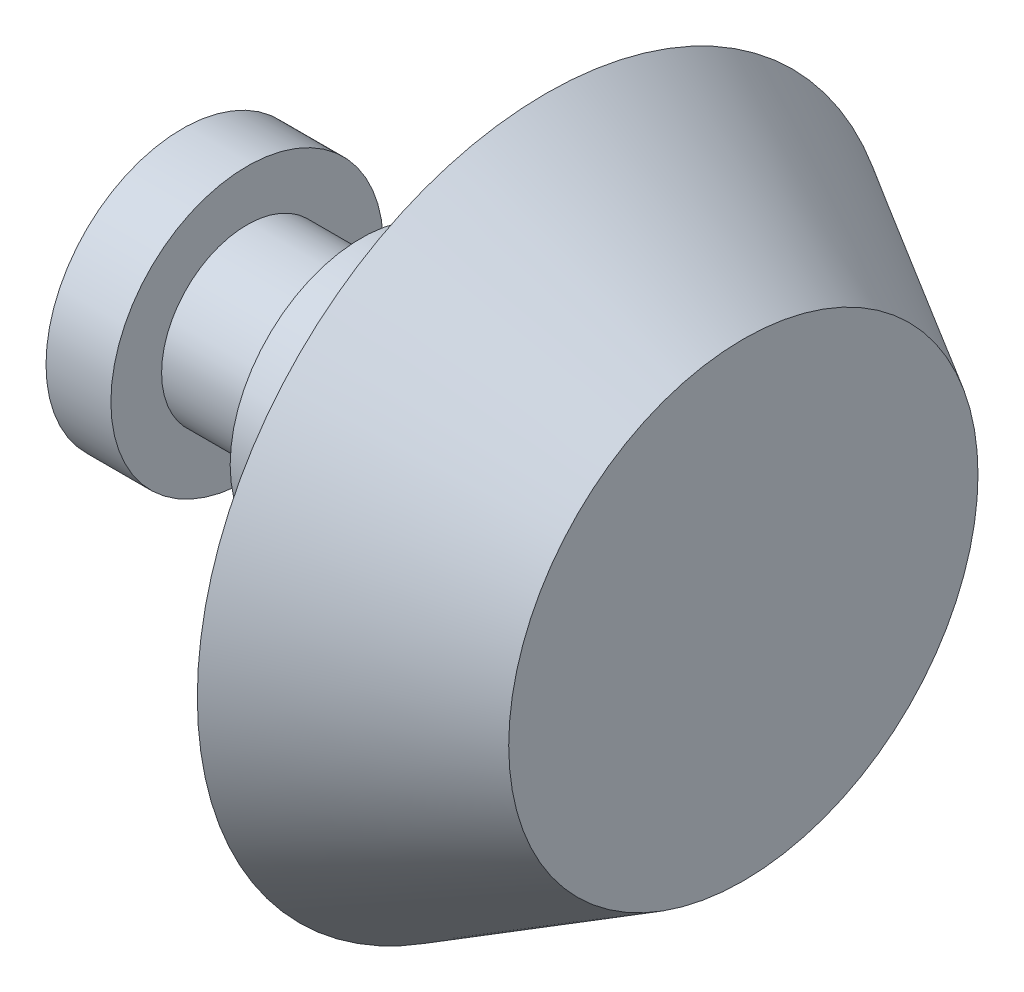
ISO-10303-21;
HEADER;
FILE_DESCRIPTION(('STEP AP214'),'2;1');
FILE_NAME('part.step','',(''),(''),'','','');
FILE_SCHEMA(('AUTOMOTIVE_DESIGN { 1 0 10303 214 1 1 1 1 }'));
ENDSEC;
DATA;
#1=APPLICATION_CONTEXT('core data for automotive mechanical design processes');
#2=APPLICATION_PROTOCOL_DEFINITION('international standard','automotive_design',2000,#1);
#3=PRODUCT_CONTEXT('',#1,'mechanical');
#4=PRODUCT('Part','Part','',(#3));
#5=PRODUCT_RELATED_PRODUCT_CATEGORY('part','',(#4));
#6=PRODUCT_DEFINITION_FORMATION('','',#4);
#7=PRODUCT_DEFINITION_CONTEXT('part definition',#1,'design');
#8=PRODUCT_DEFINITION('design','',#6,#7);
#9=PRODUCT_DEFINITION_SHAPE('','',#8);
#10=(LENGTH_UNIT() NAMED_UNIT(*) SI_UNIT(.MILLI.,.METRE.));
#11=(NAMED_UNIT(*) PLANE_ANGLE_UNIT() SI_UNIT($,.RADIAN.));
#12=(NAMED_UNIT(*) SI_UNIT($,.STERADIAN.) SOLID_ANGLE_UNIT());
#13=UNCERTAINTY_MEASURE_WITH_UNIT(LENGTH_MEASURE(1.E-05),#10,'distance_accuracy_value','');
#14=(GEOMETRIC_REPRESENTATION_CONTEXT(3) GLOBAL_UNCERTAINTY_ASSIGNED_CONTEXT((#13)) GLOBAL_UNIT_ASSIGNED_CONTEXT((#10,
#11,#12)) REPRESENTATION_CONTEXT('',''));
#15=CARTESIAN_POINT('',(0.,0.,0.));
#16=DIRECTION('',(0.,0.,1.));
#17=DIRECTION('',(1.,0.,0.));
#18=AXIS2_PLACEMENT_3D('',#15,#16,#17);
#19=CARTESIAN_POINT('',(22.1078413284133,23.9003690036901,0.));
#20=DIRECTION('',(1.,0.,0.));
#21=DIRECTION('',(0.,0.,-1.));
#22=AXIS2_PLACEMENT_3D('',#19,#20,#21);
#23=PLANE('',#22);
#24=CARTESIAN_POINT('',(22.1078413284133,0.,0.));
#25=DIRECTION('',(-1.,0.,0.));
#26=DIRECTION('',(0.,0.,1.));
#27=AXIS2_PLACEMENT_3D('',#24,#25,#26);
#28=CIRCLE('',#27,23.9003690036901);
#29=CARTESIAN_POINT('',(22.1078413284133,0.,23.9003690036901));
#30=VERTEX_POINT('',#29);
#31=EDGE_CURVE('E10',#30,#30,#28,.T.);
#32=ORIENTED_EDGE('',*,*,#31,.T.);
#33=EDGE_LOOP('',(#32));
#34=FACE_BOUND('',#33,.T.);
#35=ADVANCED_FACE('F346',(#34),#23,.F.);
#36=CARTESIAN_POINT('',(0.,0.,0.));
#37=DIRECTION('',(-1.,0.,0.));
#38=DIRECTION('',(0.,0.,1.));
#39=AXIS2_PLACEMENT_3D('',#36,#37,#38);
#40=CYLINDRICAL_SURFACE('',#39,23.9003690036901);
#41=ORIENTED_EDGE('',*,*,#31,.F.);
#42=EDGE_LOOP('',(#41));
#43=FACE_BOUND('',#42,.T.);
#44=CARTESIAN_POINT('',(33.4936346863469,0.,0.));
#45=DIRECTION('',(-1.,0.,0.));
#46=DIRECTION('',(0.,0.,1.));
#47=AXIS2_PLACEMENT_3D('',#44,#45,#46);
#48=CIRCLE('',#47,23.9003690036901);
#49=CARTESIAN_POINT('',(33.4936346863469,0.,23.9003690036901));
#50=VERTEX_POINT('',#49);
#51=EDGE_CURVE('E352',#50,#50,#48,.T.);
#52=ORIENTED_EDGE('',*,*,#51,.T.);
#53=EDGE_LOOP('',(#52));
#54=FACE_BOUND('',#53,.T.);
#55=ADVANCED_FACE('F396',(#43,#54),#40,.T.);
#56=CARTESIAN_POINT('',(33.4936346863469,15.,0.));
#57=DIRECTION('',(-1.,0.,0.));
#58=DIRECTION('',(0.,0.,1.));
#59=AXIS2_PLACEMENT_3D('',#56,#57,#58);
#60=PLANE('',#59);
#61=ORIENTED_EDGE('',*,*,#51,.F.);
#62=EDGE_LOOP('',(#61));
#63=FACE_BOUND('',#62,.T.);
#64=CARTESIAN_POINT('',(33.4936346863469,0.,0.));
#65=DIRECTION('',(-1.,0.,0.));
#66=DIRECTION('',(0.,0.,1.));
#67=AXIS2_PLACEMENT_3D('',#64,#65,#66);
#68=CIRCLE('',#67,15.);
#69=CARTESIAN_POINT('',(33.4936346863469,0.,15.));
#70=VERTEX_POINT('',#69);
#71=EDGE_CURVE('E356',#70,#70,#68,.T.);
#72=ORIENTED_EDGE('',*,*,#71,.T.);
#73=EDGE_LOOP('',(#72));
#74=FACE_BOUND('',#73,.T.);
#75=ADVANCED_FACE('F400',(#63,#74),#60,.F.);
#76=CARTESIAN_POINT('',(0.,0.,0.));
#77=DIRECTION('',(-1.,0.,0.));
#78=DIRECTION('',(0.,0.,1.));
#79=AXIS2_PLACEMENT_3D('',#76,#77,#78);
#80=CYLINDRICAL_SURFACE('',#79,15.);
#81=ORIENTED_EDGE('',*,*,#71,.F.);
#82=EDGE_LOOP('',(#81));
#83=FACE_BOUND('',#82,.T.);
#84=CARTESIAN_POINT('',(53.4936346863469,0.,0.));
#85=DIRECTION('',(-1.,0.,0.));
#86=DIRECTION('',(0.,0.,1.));
#87=AXIS2_PLACEMENT_3D('',#84,#85,#86);
#88=CIRCLE('',#87,15.);
#89=CARTESIAN_POINT('',(53.4936346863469,0.,15.));
#90=VERTEX_POINT('',#89);
#91=EDGE_CURVE('E360',#90,#90,#88,.T.);
#92=ORIENTED_EDGE('',*,*,#91,.T.);
#93=EDGE_LOOP('',(#92));
#94=FACE_BOUND('',#93,.T.);
#95=ADVANCED_FACE('F405',(#83,#94),#80,.T.);
#96=CARTESIAN_POINT('',(53.4936346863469,22.9667896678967,0.));
#97=DIRECTION('',(1.,0.,0.));
#98=DIRECTION('',(0.,0.,-1.));
#99=AXIS2_PLACEMENT_3D('',#96,#97,#98);
#100=PLANE('',#99);
#101=ORIENTED_EDGE('',*,*,#91,.F.);
#102=EDGE_LOOP('',(#101));
#103=FACE_BOUND('',#102,.T.);
#104=CARTESIAN_POINT('',(53.4936346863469,0.,0.));
#105=DIRECTION('',(-1.,0.,0.));
#106=DIRECTION('',(0.,0.,1.));
#107=AXIS2_PLACEMENT_3D('',#104,#105,#106);
#108=CIRCLE('',#107,22.9667896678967);
#109=CARTESIAN_POINT('',(53.4936346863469,0.,22.9667896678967));
#110=VERTEX_POINT('',#109);
#111=EDGE_CURVE('E365',#110,#110,#108,.T.);
#112=ORIENTED_EDGE('',*,*,#111,.T.);
#113=EDGE_LOOP('',(#112));
#114=FACE_BOUND('',#113,.T.);
#115=ADVANCED_FACE('F411',(#103,#114),#100,.F.);
#116=CARTESIAN_POINT('',(0.,0.,0.));
#117=DIRECTION('',(-1.,0.,0.));
#118=DIRECTION('',(0.,0.,1.));
#119=AXIS2_PLACEMENT_3D('',#116,#117,#118);
#120=CYLINDRICAL_SURFACE('',#119,22.9667896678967);
#121=ORIENTED_EDGE('',*,*,#111,.F.);
#122=EDGE_LOOP('',(#121));
#123=FACE_BOUND('',#122,.T.);
#124=CARTESIAN_POINT('',(62.2571033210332,0.,0.));
#125=DIRECTION('',(-1.,0.,0.));
#126=DIRECTION('',(0.,0.,1.));
#127=AXIS2_PLACEMENT_3D('',#124,#125,#126);
#128=CIRCLE('',#127,22.9667896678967);
#129=CARTESIAN_POINT('',(62.2571033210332,0.,22.9667896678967));
#130=VERTEX_POINT('',#129);
#131=EDGE_CURVE('E368',#130,#130,#128,.T.);
#132=ORIENTED_EDGE('',*,*,#131,.T.);
#133=EDGE_LOOP('',(#132));
#134=FACE_BOUND('',#133,.T.);
#135=ADVANCED_FACE('F415',(#123,#134),#120,.T.);
#136=CARTESIAN_POINT('',(62.2571033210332,15.,0.));
#137=DIRECTION('',(-1.,0.,0.));
#138=DIRECTION('',(0.,0.,1.));
#139=AXIS2_PLACEMENT_3D('',#136,#137,#138);
#140=PLANE('',#139);
#141=ORIENTED_EDGE('',*,*,#131,.F.);
#142=EDGE_LOOP('',(#141));
#143=FACE_BOUND('',#142,.T.);
#144=CARTESIAN_POINT('',(62.2571033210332,0.,0.));
#145=DIRECTION('',(-1.,0.,0.));
#146=DIRECTION('',(0.,0.,1.));
#147=AXIS2_PLACEMENT_3D('',#144,#145,#146);
#148=CIRCLE('',#147,15.);
#149=CARTESIAN_POINT('',(62.2571033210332,0.,15.));
#150=VERTEX_POINT('',#149);
#151=EDGE_CURVE('E371',#150,#150,#148,.T.);
#152=ORIENTED_EDGE('',*,*,#151,.T.);
#153=EDGE_LOOP('',(#152));
#154=FACE_BOUND('',#153,.T.);
#155=ADVANCED_FACE('F419',(#143,#154),#140,.F.);
#156=CARTESIAN_POINT('',(0.,0.,0.));
#157=DIRECTION('',(-1.,0.,0.));
#158=DIRECTION('',(0.,0.,1.));
#159=AXIS2_PLACEMENT_3D('',#156,#157,#158);
#160=CYLINDRICAL_SURFACE('',#159,15.);
#161=ORIENTED_EDGE('',*,*,#151,.F.);
#162=EDGE_LOOP('',(#161));
#163=FACE_BOUND('',#162,.T.);
#164=CARTESIAN_POINT('',(85.9391156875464,0.,0.));
#165=DIRECTION('',(-1.,0.,0.));
#166=DIRECTION('',(0.,0.,1.));
#167=AXIS2_PLACEMENT_3D('',#164,#165,#166);
#168=CIRCLE('',#167,15.);
#169=CARTESIAN_POINT('',(85.9391156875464,0.,15.));
#170=VERTEX_POINT('',#169);
#171=EDGE_CURVE('E374',#170,#170,#168,.T.);
#172=ORIENTED_EDGE('',*,*,#171,.T.);
#173=EDGE_LOOP('',(#172));
#174=FACE_BOUND('',#173,.T.);
#175=ADVANCED_FACE('F423',(#163,#174),#160,.T.);
#176=CARTESIAN_POINT('',(85.9391156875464,61.1777078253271,0.));
#177=DIRECTION('',(1.,0.,0.));
#178=DIRECTION('',(0.,0.,-1.));
#179=AXIS2_PLACEMENT_3D('',#176,#177,#178);
#180=PLANE('',#179);
#181=ORIENTED_EDGE('',*,*,#171,.F.);
#182=EDGE_LOOP('',(#181));
#183=FACE_BOUND('',#182,.T.);
#184=CARTESIAN_POINT('',(85.9391156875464,0.,0.));
#185=DIRECTION('',(-1.,0.,0.));
#186=DIRECTION('',(0.,0.,1.));
#187=AXIS2_PLACEMENT_3D('',#184,#185,#186);
#188=CIRCLE('',#187,61.1777078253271);
#189=CARTESIAN_POINT('',(85.9391156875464,0.,61.1777078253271));
#190=VERTEX_POINT('',#189);
#191=EDGE_CURVE('E377',#190,#190,#188,.T.);
#192=ORIENTED_EDGE('',*,*,#191,.T.);
#193=EDGE_LOOP('',(#192));
#194=FACE_BOUND('',#193,.T.);
#195=ADVANCED_FACE('F392',(#183,#194),#180,.F.);
#196=CARTESIAN_POINT('',(120.580912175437,0.,0.));
#197=DIRECTION('',(-1.,0.,0.));
#198=DIRECTION('',(0.,0.,1.));
#199=AXIS2_PLACEMENT_3D('',#196,#197,#198);
#200=CONICAL_SURFACE('',#199,41.1772572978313,0.523598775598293);
#201=ORIENTED_EDGE('',*,*,#191,.F.);
#202=EDGE_LOOP('',(#201));
#203=FACE_BOUND('',#202,.T.);
#204=CARTESIAN_POINT('',(120.580912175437,0.,0.));
#205=DIRECTION('',(-1.,0.,0.));
#206=DIRECTION('',(0.,0.,1.));
#207=AXIS2_PLACEMENT_3D('',#204,#205,#206);
#208=CIRCLE('',#207,41.1772572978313);
#209=CARTESIAN_POINT('',(120.580912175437,0.,41.1772572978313));
#210=VERTEX_POINT('',#209);
#211=EDGE_CURVE('E380',#210,#210,#208,.T.);
#212=ORIENTED_EDGE('',*,*,#211,.T.);
#213=EDGE_LOOP('',(#212));
#214=FACE_BOUND('',#213,.T.);
#215=ADVANCED_FACE('F384',(#203,#214),#200,.T.);
#216=CARTESIAN_POINT('',(120.580912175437,0.,0.));
#217=DIRECTION('',(-1.,0.,0.));
#218=DIRECTION('',(0.,0.,1.));
#219=AXIS2_PLACEMENT_3D('',#216,#217,#218);
#220=PLANE('',#219);
#221=ORIENTED_EDGE('',*,*,#211,.F.);
#222=EDGE_LOOP('',(#221));
#223=FACE_BOUND('',#222,.T.);
#224=ADVANCED_FACE('F386',(#223),#220,.F.);
#225=CLOSED_SHELL('',(#35,#55,#75,#95,#115,#135,#155,#175,#195,#215,#224));
#226=MANIFOLD_SOLID_BREP('B2',#225);
#227=ADVANCED_BREP_SHAPE_REPRESENTATION('',(#18,#226),#14);
#228=SHAPE_DEFINITION_REPRESENTATION(#9,#227);
ENDSEC;
END-ISO-10303-21;
